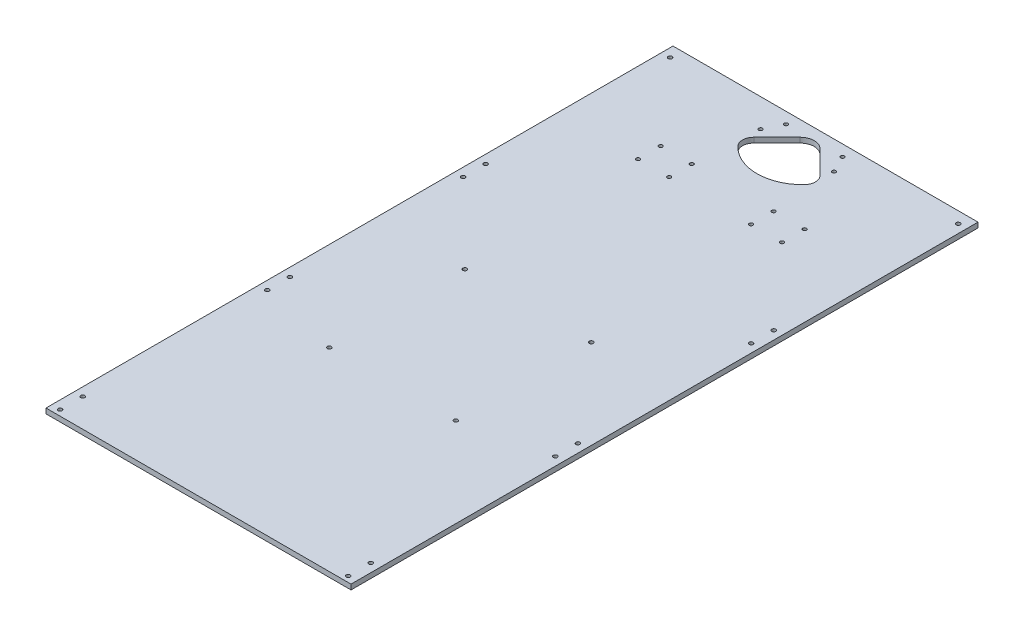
ISO-10303-21;
HEADER;
FILE_DESCRIPTION(('STEP AP214'),'2;1');
FILE_NAME('part.step','',(''),(''),'','','');
FILE_SCHEMA(('AUTOMOTIVE_DESIGN { 1 0 10303 214 1 1 1 1 }'));
ENDSEC;
DATA;
#1=APPLICATION_CONTEXT('core data for automotive mechanical design processes');
#2=APPLICATION_PROTOCOL_DEFINITION('international standard','automotive_design',2000,#1);
#3=PRODUCT_CONTEXT('',#1,'mechanical');
#4=PRODUCT('Part','Part','',(#3));
#5=PRODUCT_RELATED_PRODUCT_CATEGORY('part','',(#4));
#6=PRODUCT_DEFINITION_FORMATION('','',#4);
#7=PRODUCT_DEFINITION_CONTEXT('part definition',#1,'design');
#8=PRODUCT_DEFINITION('design','',#6,#7);
#9=PRODUCT_DEFINITION_SHAPE('','',#8);
#10=(LENGTH_UNIT() NAMED_UNIT(*) SI_UNIT(.MILLI.,.METRE.));
#11=(NAMED_UNIT(*) PLANE_ANGLE_UNIT() SI_UNIT($,.RADIAN.));
#12=(NAMED_UNIT(*) SI_UNIT($,.STERADIAN.) SOLID_ANGLE_UNIT());
#13=UNCERTAINTY_MEASURE_WITH_UNIT(LENGTH_MEASURE(1.E-05),#10,'distance_accuracy_value','');
#14=(GEOMETRIC_REPRESENTATION_CONTEXT(3) GLOBAL_UNCERTAINTY_ASSIGNED_CONTEXT((#13)) GLOBAL_UNIT_ASSIGNED_CONTEXT((#10,
#11,#12)) REPRESENTATION_CONTEXT('',''));
#15=CARTESIAN_POINT('',(0.,0.,0.));
#16=DIRECTION('',(0.,0.,1.));
#17=DIRECTION('',(1.,0.,0.));
#18=AXIS2_PLACEMENT_3D('',#15,#16,#17);
#19=CARTESIAN_POINT('',(0.,9.,-79.9999999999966));
#20=DIRECTION('',(0.,-1.,0.));
#21=DIRECTION('',(0.,0.,-1.));
#22=AXIS2_PLACEMENT_3D('',#19,#20,#21);
#23=CYLINDRICAL_SURFACE('',#22,81.4159283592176);
#24=CARTESIAN_POINT('',(0.,9.,-79.9999999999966));
#25=DIRECTION('',(0.,1.,0.));
#26=DIRECTION('',(0.,0.,1.));
#27=AXIS2_PLACEMENT_3D('',#24,#25,#26);
#28=CIRCLE('',#27,81.4159283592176);
#29=CARTESIAN_POINT('',(-58.9261399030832,9.,-23.8193678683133));
#30=VERTEX_POINT('',#29);
#31=CARTESIAN_POINT('',(58.9261399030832,9.,-23.8193678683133));
#32=VERTEX_POINT('',#31);
#33=EDGE_CURVE('E258',#30,#32,#28,.T.);
#34=ORIENTED_EDGE('',*,*,#33,.T.);
#35=DIRECTION('',(0.,-1.,0.));
#36=VECTOR('',#35,1.);
#37=CARTESIAN_POINT('',(58.9261399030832,9.,-23.8193678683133));
#38=LINE('',#37,#36);
#39=CARTESIAN_POINT('',(58.9261399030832,0.,-23.8193678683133));
#40=VERTEX_POINT('',#39);
#41=EDGE_CURVE('E350',#32,#40,#38,.T.);
#42=ORIENTED_EDGE('',*,*,#41,.T.);
#43=CARTESIAN_POINT('',(0.,0.,-79.9999999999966));
#44=DIRECTION('',(0.,1.,0.));
#45=DIRECTION('',(0.,0.,1.));
#46=AXIS2_PLACEMENT_3D('',#43,#44,#45);
#47=CIRCLE('',#46,81.4159283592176);
#48=CARTESIAN_POINT('',(-58.9261399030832,0.,-23.8193678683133));
#49=VERTEX_POINT('',#48);
#50=EDGE_CURVE('E314',#49,#40,#47,.T.);
#51=ORIENTED_EDGE('',*,*,#50,.F.);
#52=DIRECTION('',(0.,-1.,0.));
#53=VECTOR('',#52,1.);
#54=CARTESIAN_POINT('',(-58.9261399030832,9.,-23.8193678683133));
#55=LINE('',#54,#53);
#56=EDGE_CURVE('E344',#49,#30,#55,.F.);
#57=ORIENTED_EDGE('',*,*,#56,.T.);
#58=EDGE_LOOP('',(#34,#42,#51,#57));
#59=FACE_BOUND('',#58,.T.);
#60=ADVANCED_FACE('F45',(#59),#23,.F.);
#61=CARTESIAN_POINT('',(-55.177669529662,9.,-55.1776695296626));
#62=DIRECTION('',(0.707106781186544,0.,0.707106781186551));
#63=DIRECTION('',(0.707106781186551,0.,-0.707106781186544));
#64=AXIS2_PLACEMENT_3D('',#61,#62,#63);
#65=PLANE('',#64);
#66=DIRECTION('',(-0.707106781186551,0.,0.707106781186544));
#67=VECTOR('',#66,1.);
#68=CARTESIAN_POINT('',(-55.177669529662,9.,-55.1776695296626));
#69=LINE('',#68,#67);
#70=CARTESIAN_POINT('',(-17.6776695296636,9.,-92.6776695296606));
#71=VERTEX_POINT('',#70);
#72=CARTESIAN_POINT('',(-58.5929410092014,9.,-51.7623980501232));
#73=VERTEX_POINT('',#72);
#74=EDGE_CURVE('E261',#71,#73,#69,.T.);
#75=ORIENTED_EDGE('',*,*,#74,.T.);
#76=DIRECTION('',(0.,1.,0.));
#77=VECTOR('',#76,1.);
#78=CARTESIAN_POINT('',(-58.5929410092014,0.,-51.7623980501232));
#79=LINE('',#78,#77);
#80=CARTESIAN_POINT('',(-58.5929410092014,0.,-51.7623980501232));
#81=VERTEX_POINT('',#80);
#82=EDGE_CURVE('E341',#73,#81,#79,.F.);
#83=ORIENTED_EDGE('',*,*,#82,.T.);
#84=DIRECTION('',(-0.707106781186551,0.,0.707106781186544));
#85=VECTOR('',#84,1.);
#86=CARTESIAN_POINT('',(-55.177669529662,0.,-55.1776695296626));
#87=LINE('',#86,#85);
#88=CARTESIAN_POINT('',(-17.6776695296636,0.,-92.6776695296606));
#89=VERTEX_POINT('',#88);
#90=EDGE_CURVE('E316',#89,#81,#87,.T.);
#91=ORIENTED_EDGE('',*,*,#90,.F.);
#92=DIRECTION('',(0.,-1.,0.));
#93=VECTOR('',#92,1.);
#94=CARTESIAN_POINT('',(-17.6776695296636,9.,-92.6776695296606));
#95=LINE('',#94,#93);
#96=EDGE_CURVE('E339',#71,#89,#95,.T.);
#97=ORIENTED_EDGE('',*,*,#96,.F.);
#98=EDGE_LOOP('',(#75,#83,#91,#97));
#99=FACE_BOUND('',#98,.T.);
#100=ADVANCED_FACE('F368',(#99),#65,.T.);
#101=CARTESIAN_POINT('',(0.,9.,-74.9999999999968));
#102=DIRECTION('',(0.,-1.,0.));
#103=DIRECTION('',(0.,0.,-1.));
#104=AXIS2_PLACEMENT_3D('',#101,#102,#103);
#105=CYLINDRICAL_SURFACE('',#104,25.);
#106=CARTESIAN_POINT('',(0.,0.,-74.9999999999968));
#107=DIRECTION('',(0.,1.,0.));
#108=DIRECTION('',(0.,0.,1.));
#109=AXIS2_PLACEMENT_3D('',#106,#107,#108);
#110=CIRCLE('',#109,25.);
#111=CARTESIAN_POINT('',(17.6776695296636,0.,-92.6776695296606));
#112=VERTEX_POINT('',#111);
#113=EDGE_CURVE('E319',#112,#89,#110,.T.);
#114=ORIENTED_EDGE('',*,*,#113,.F.);
#115=DIRECTION('',(0.,-1.,0.));
#116=VECTOR('',#115,1.);
#117=CARTESIAN_POINT('',(17.6776695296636,9.,-92.6776695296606));
#118=LINE('',#117,#116);
#119=CARTESIAN_POINT('',(17.6776695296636,9.,-92.6776695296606));
#120=VERTEX_POINT('',#119);
#121=EDGE_CURVE('E167',#120,#112,#118,.T.);
#122=ORIENTED_EDGE('',*,*,#121,.F.);
#123=CARTESIAN_POINT('',(0.,9.,-74.9999999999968));
#124=DIRECTION('',(0.,1.,0.));
#125=DIRECTION('',(0.,0.,1.));
#126=AXIS2_PLACEMENT_3D('',#123,#124,#125);
#127=CIRCLE('',#126,25.);
#128=EDGE_CURVE('E264',#120,#71,#127,.T.);
#129=ORIENTED_EDGE('',*,*,#128,.T.);
#130=ORIENTED_EDGE('',*,*,#96,.T.);
#131=EDGE_LOOP('',(#114,#122,#129,#130));
#132=FACE_BOUND('',#131,.T.);
#133=ADVANCED_FACE('F374',(#132),#105,.F.);
#134=CARTESIAN_POINT('',(0.,9.,-119.999999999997));
#135=DIRECTION('',(0.,0.,-1.));
#136=DIRECTION('',(-1.,0.,0.));
#137=AXIS2_PLACEMENT_3D('',#134,#135,#136);
#138=PLANE('',#137);
#139=DIRECTION('',(1.,0.,0.));
#140=VECTOR('',#139,1.);
#141=CARTESIAN_POINT('',(0.,0.,-119.999999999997));
#142=LINE('',#141,#140);
#143=CARTESIAN_POINT('',(-270.,0.,-119.999999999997));
#144=VERTEX_POINT('',#143);
#145=CARTESIAN_POINT('',(270.,0.,-119.999999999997));
#146=VERTEX_POINT('',#145);
#147=EDGE_CURVE('E322',#144,#146,#142,.T.);
#148=ORIENTED_EDGE('',*,*,#147,.F.);
#149=DIRECTION('',(0.,-1.,0.));
#150=VECTOR('',#149,1.);
#151=CARTESIAN_POINT('',(-270.,9.,-119.999999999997));
#152=LINE('',#151,#150);
#153=CARTESIAN_POINT('',(-270.,9.,-119.999999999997));
#154=VERTEX_POINT('',#153);
#155=EDGE_CURVE('E337',#154,#144,#152,.T.);
#156=ORIENTED_EDGE('',*,*,#155,.F.);
#157=DIRECTION('',(1.,0.,0.));
#158=VECTOR('',#157,1.);
#159=CARTESIAN_POINT('',(0.,9.,-119.999999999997));
#160=LINE('',#159,#158);
#161=CARTESIAN_POINT('',(270.,9.,-119.999999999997));
#162=VERTEX_POINT('',#161);
#163=EDGE_CURVE('E267',#154,#162,#160,.T.);
#164=ORIENTED_EDGE('',*,*,#163,.T.);
#165=DIRECTION('',(0.,-1.,0.));
#166=VECTOR('',#165,1.);
#167=CARTESIAN_POINT('',(270.,9.,-119.999999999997));
#168=LINE('',#167,#166);
#169=EDGE_CURVE('E144',#162,#146,#168,.T.);
#170=ORIENTED_EDGE('',*,*,#169,.T.);
#171=EDGE_LOOP('',(#148,#156,#164,#170));
#172=FACE_BOUND('',#171,.T.);
#173=ADVANCED_FACE('F473',(#172),#138,.T.);
#174=CARTESIAN_POINT('',(-270.,9.,0.));
#175=DIRECTION('',(1.,0.,0.));
#176=DIRECTION('',(0.,0.,-1.));
#177=AXIS2_PLACEMENT_3D('',#174,#175,#176);
#178=PLANE('',#177);
#179=DIRECTION('',(0.,0.,1.));
#180=VECTOR('',#179,1.);
#181=CARTESIAN_POINT('',(-270.,0.,0.));
#182=LINE('',#181,#180);
#183=CARTESIAN_POINT('',(-270.,0.,990.000000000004));
#184=VERTEX_POINT('',#183);
#185=EDGE_CURVE('E324',#144,#184,#182,.T.);
#186=ORIENTED_EDGE('',*,*,#185,.T.);
#187=DIRECTION('',(0.,-1.,0.));
#188=VECTOR('',#187,1.);
#189=CARTESIAN_POINT('',(-270.,9.,990.000000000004));
#190=LINE('',#189,#188);
#191=CARTESIAN_POINT('',(-270.,9.,990.000000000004));
#192=VERTEX_POINT('',#191);
#193=EDGE_CURVE('E278',#192,#184,#190,.T.);
#194=ORIENTED_EDGE('',*,*,#193,.F.);
#195=DIRECTION('',(0.,0.,1.));
#196=VECTOR('',#195,1.);
#197=CARTESIAN_POINT('',(-270.,9.,0.));
#198=LINE('',#197,#196);
#199=EDGE_CURVE('E130',#154,#192,#198,.T.);
#200=ORIENTED_EDGE('',*,*,#199,.F.);
#201=ORIENTED_EDGE('',*,*,#155,.T.);
#202=EDGE_LOOP('',(#186,#194,#200,#201));
#203=FACE_BOUND('',#202,.T.);
#204=ADVANCED_FACE('F470',(#203),#178,.F.);
#205=CARTESIAN_POINT('',(0.,9.,990.000000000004));
#206=DIRECTION('',(0.,0.,-1.));
#207=DIRECTION('',(-1.,0.,0.));
#208=AXIS2_PLACEMENT_3D('',#205,#206,#207);
#209=PLANE('',#208);
#210=DIRECTION('',(1.,0.,0.));
#211=VECTOR('',#210,1.);
#212=CARTESIAN_POINT('',(0.,0.,990.000000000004));
#213=LINE('',#212,#211);
#214=CARTESIAN_POINT('',(270.,0.,990.000000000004));
#215=VERTEX_POINT('',#214);
#216=EDGE_CURVE('E139',#184,#215,#213,.T.);
#217=ORIENTED_EDGE('',*,*,#216,.T.);
#218=DIRECTION('',(0.,-1.,0.));
#219=VECTOR('',#218,1.);
#220=CARTESIAN_POINT('',(270.,9.,990.000000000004));
#221=LINE('',#220,#219);
#222=CARTESIAN_POINT('',(270.,9.,990.000000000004));
#223=VERTEX_POINT('',#222);
#224=EDGE_CURVE('E137',#223,#215,#221,.T.);
#225=ORIENTED_EDGE('',*,*,#224,.F.);
#226=DIRECTION('',(1.,0.,0.));
#227=VECTOR('',#226,1.);
#228=CARTESIAN_POINT('',(0.,9.,990.000000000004));
#229=LINE('',#228,#227);
#230=EDGE_CURVE('E122',#192,#223,#229,.T.);
#231=ORIENTED_EDGE('',*,*,#230,.F.);
#232=ORIENTED_EDGE('',*,*,#193,.T.);
#233=EDGE_LOOP('',(#217,#225,#231,#232));
#234=FACE_BOUND('',#233,.T.);
#235=ADVANCED_FACE('F138',(#234),#209,.F.);
#236=CARTESIAN_POINT('',(-112.,9.,406.483912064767));
#237=DIRECTION('',(0.,-1.,0.));
#238=DIRECTION('',(0.,0.,-1.));
#239=AXIS2_PLACEMENT_3D('',#236,#237,#238);
#240=CYLINDRICAL_SURFACE('',#239,3.49999999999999);
#241=CARTESIAN_POINT('',(-112.,9.,406.483912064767));
#242=DIRECTION('',(0.,1.,0.));
#243=DIRECTION('',(0.,0.,1.));
#244=AXIS2_PLACEMENT_3D('',#241,#242,#243);
#245=CIRCLE('',#244,3.49999999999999);
#246=CARTESIAN_POINT('',(-112.,9.,409.983912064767));
#247=VERTEX_POINT('',#246);
#248=EDGE_CURVE('E272',#247,#247,#245,.T.);
#249=ORIENTED_EDGE('',*,*,#248,.T.);
#250=EDGE_LOOP('',(#249));
#251=FACE_BOUND('',#250,.T.);
#252=CARTESIAN_POINT('',(-112.,0.,406.483912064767));
#253=DIRECTION('',(0.,1.,0.));
#254=DIRECTION('',(0.,0.,1.));
#255=AXIS2_PLACEMENT_3D('',#252,#253,#254);
#256=CIRCLE('',#255,3.49999999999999);
#257=CARTESIAN_POINT('',(-112.,0.,409.983912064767));
#258=VERTEX_POINT('',#257);
#259=EDGE_CURVE('E331',#258,#258,#256,.T.);
#260=ORIENTED_EDGE('',*,*,#259,.F.);
#261=EDGE_LOOP('',(#260));
#262=FACE_BOUND('',#261,.T.);
#263=ADVANCED_FACE('F461',(#251,#262),#240,.F.);
#264=CARTESIAN_POINT('',(-112.,9.,646.483912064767));
#265=DIRECTION('',(0.,-1.,0.));
#266=DIRECTION('',(0.,0.,-1.));
#267=AXIS2_PLACEMENT_3D('',#264,#265,#266);
#268=CYLINDRICAL_SURFACE('',#267,3.49999999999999);
#269=CARTESIAN_POINT('',(-112.,9.,646.483912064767));
#270=DIRECTION('',(0.,1.,0.));
#271=DIRECTION('',(0.,0.,1.));
#272=AXIS2_PLACEMENT_3D('',#269,#270,#271);
#273=CIRCLE('',#272,3.49999999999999);
#274=CARTESIAN_POINT('',(-112.,9.,649.983912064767));
#275=VERTEX_POINT('',#274);
#276=EDGE_CURVE('E134',#275,#275,#273,.T.);
#277=ORIENTED_EDGE('',*,*,#276,.T.);
#278=EDGE_LOOP('',(#277));
#279=FACE_BOUND('',#278,.T.);
#280=CARTESIAN_POINT('',(-112.,0.,646.483912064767));
#281=DIRECTION('',(0.,1.,0.));
#282=DIRECTION('',(0.,0.,1.));
#283=AXIS2_PLACEMENT_3D('',#280,#281,#282);
#284=CIRCLE('',#283,3.49999999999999);
#285=CARTESIAN_POINT('',(-112.,0.,649.983912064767));
#286=VERTEX_POINT('',#285);
#287=EDGE_CURVE('E328',#286,#286,#284,.T.);
#288=ORIENTED_EDGE('',*,*,#287,.F.);
#289=EDGE_LOOP('',(#288));
#290=FACE_BOUND('',#289,.T.);
#291=ADVANCED_FACE('F398',(#279,#290),#268,.F.);
#292=CARTESIAN_POINT('',(-65.,9.,-69.9999999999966));
#293=DIRECTION('',(0.,-1.,0.));
#294=DIRECTION('',(0.,0.,-1.));
#295=AXIS2_PLACEMENT_3D('',#292,#293,#294);
#296=CYLINDRICAL_SURFACE('',#295,3.25000000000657);
#297=CARTESIAN_POINT('',(-65.,9.,-69.9999999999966));
#298=DIRECTION('',(0.,1.,0.));
#299=DIRECTION('',(0.,0.,1.));
#300=AXIS2_PLACEMENT_3D('',#297,#298,#299);
#301=CIRCLE('',#300,3.25000000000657);
#302=CARTESIAN_POINT('',(-65.,9.,-66.74999999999));
#303=VERTEX_POINT('',#302);
#304=EDGE_CURVE('E255',#303,#303,#301,.T.);
#305=ORIENTED_EDGE('',*,*,#304,.T.);
#306=EDGE_LOOP('',(#305));
#307=FACE_BOUND('',#306,.T.);
#308=CARTESIAN_POINT('',(-65.,0.,-69.9999999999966));
#309=DIRECTION('',(0.,1.,0.));
#310=DIRECTION('',(0.,0.,1.));
#311=AXIS2_PLACEMENT_3D('',#308,#309,#310);
#312=CIRCLE('',#311,3.25000000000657);
#313=CARTESIAN_POINT('',(-65.,0.,-66.74999999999));
#314=VERTEX_POINT('',#313);
#315=EDGE_CURVE('E311',#314,#314,#312,.T.);
#316=ORIENTED_EDGE('',*,*,#315,.F.);
#317=EDGE_LOOP('',(#316));
#318=FACE_BOUND('',#317,.T.);
#319=ADVANCED_FACE('F394',(#307,#318),#296,.F.);
#320=CARTESIAN_POINT('',(-127.5,9.,44.3400000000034));
#321=DIRECTION('',(0.,-1.,0.));
#322=DIRECTION('',(0.,0.,-1.));
#323=AXIS2_PLACEMENT_3D('',#320,#321,#322);
#324=CYLINDRICAL_SURFACE('',#323,3.25000000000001);
#325=CARTESIAN_POINT('',(-127.5,9.,44.3400000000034));
#326=DIRECTION('',(0.,1.,0.));
#327=DIRECTION('',(0.,0.,1.));
#328=AXIS2_PLACEMENT_3D('',#325,#326,#327);
#329=CIRCLE('',#328,3.25000000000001);
#330=CARTESIAN_POINT('',(-127.5,9.,47.5900000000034));
#331=VERTEX_POINT('',#330);
#332=EDGE_CURVE('E252',#331,#331,#329,.T.);
#333=ORIENTED_EDGE('',*,*,#332,.T.);
#334=EDGE_LOOP('',(#333));
#335=FACE_BOUND('',#334,.T.);
#336=CARTESIAN_POINT('',(-127.5,0.,44.3400000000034));
#337=DIRECTION('',(0.,1.,0.));
#338=DIRECTION('',(0.,0.,1.));
#339=AXIS2_PLACEMENT_3D('',#336,#337,#338);
#340=CIRCLE('',#339,3.25000000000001);
#341=CARTESIAN_POINT('',(-127.5,0.,47.5900000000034));
#342=VERTEX_POINT('',#341);
#343=EDGE_CURVE('E308',#342,#342,#340,.T.);
#344=ORIENTED_EDGE('',*,*,#343,.F.);
#345=EDGE_LOOP('',(#344));
#346=FACE_BOUND('',#345,.T.);
#347=ADVANCED_FACE('F397',(#335,#346),#324,.F.);
#348=CARTESIAN_POINT('',(-72.5,9.,44.3400000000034));
#349=DIRECTION('',(0.,-1.,0.));
#350=DIRECTION('',(0.,0.,-1.));
#351=AXIS2_PLACEMENT_3D('',#348,#349,#350);
#352=CYLINDRICAL_SURFACE('',#351,3.25000000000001);
#353=CARTESIAN_POINT('',(-72.5,9.,44.3400000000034));
#354=DIRECTION('',(0.,1.,0.));
#355=DIRECTION('',(0.,0.,1.));
#356=AXIS2_PLACEMENT_3D('',#353,#354,#355);
#357=CIRCLE('',#356,3.25000000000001);
#358=CARTESIAN_POINT('',(-72.5,9.,47.5900000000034));
#359=VERTEX_POINT('',#358);
#360=EDGE_CURVE('E249',#359,#359,#357,.T.);
#361=ORIENTED_EDGE('',*,*,#360,.T.);
#362=EDGE_LOOP('',(#361));
#363=FACE_BOUND('',#362,.T.);
#364=CARTESIAN_POINT('',(-72.5,0.,44.3400000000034));
#365=DIRECTION('',(0.,1.,0.));
#366=DIRECTION('',(0.,0.,1.));
#367=AXIS2_PLACEMENT_3D('',#364,#365,#366);
#368=CIRCLE('',#367,3.25000000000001);
#369=CARTESIAN_POINT('',(-72.5,0.,47.5900000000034));
#370=VERTEX_POINT('',#369);
#371=EDGE_CURVE('E305',#370,#370,#368,.T.);
#372=ORIENTED_EDGE('',*,*,#371,.F.);
#373=EDGE_LOOP('',(#372));
#374=FACE_BOUND('',#373,.T.);
#375=ADVANCED_FACE('F402',(#363,#374),#352,.F.);
#376=CARTESIAN_POINT('',(-72.5,9.,84.3400000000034));
#377=DIRECTION('',(0.,-1.,0.));
#378=DIRECTION('',(0.,0.,-1.));
#379=AXIS2_PLACEMENT_3D('',#376,#377,#378);
#380=CYLINDRICAL_SURFACE('',#379,3.25000000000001);
#381=CARTESIAN_POINT('',(-72.5,9.,84.3400000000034));
#382=DIRECTION('',(0.,1.,0.));
#383=DIRECTION('',(0.,0.,1.));
#384=AXIS2_PLACEMENT_3D('',#381,#382,#383);
#385=CIRCLE('',#384,3.25000000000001);
#386=CARTESIAN_POINT('',(-72.5,9.,87.5900000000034));
#387=VERTEX_POINT('',#386);
#388=EDGE_CURVE('E246',#387,#387,#385,.T.);
#389=ORIENTED_EDGE('',*,*,#388,.T.);
#390=EDGE_LOOP('',(#389));
#391=FACE_BOUND('',#390,.T.);
#392=CARTESIAN_POINT('',(-72.5,0.,84.3400000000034));
#393=DIRECTION('',(0.,1.,0.));
#394=DIRECTION('',(0.,0.,1.));
#395=AXIS2_PLACEMENT_3D('',#392,#393,#394);
#396=CIRCLE('',#395,3.25000000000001);
#397=CARTESIAN_POINT('',(-72.5,0.,87.5900000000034));
#398=VERTEX_POINT('',#397);
#399=EDGE_CURVE('E302',#398,#398,#396,.T.);
#400=ORIENTED_EDGE('',*,*,#399,.F.);
#401=EDGE_LOOP('',(#400));
#402=FACE_BOUND('',#401,.T.);
#403=ADVANCED_FACE('F406',(#391,#402),#380,.F.);
#404=CARTESIAN_POINT('',(-127.5,9.,84.3400000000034));
#405=DIRECTION('',(0.,-1.,0.));
#406=DIRECTION('',(0.,0.,-1.));
#407=AXIS2_PLACEMENT_3D('',#404,#405,#406);
#408=CYLINDRICAL_SURFACE('',#407,3.25000000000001);
#409=CARTESIAN_POINT('',(-127.5,9.,84.3400000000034));
#410=DIRECTION('',(0.,1.,0.));
#411=DIRECTION('',(0.,0.,1.));
#412=AXIS2_PLACEMENT_3D('',#409,#410,#411);
#413=CIRCLE('',#412,3.25000000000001);
#414=CARTESIAN_POINT('',(-127.5,9.,87.5900000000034));
#415=VERTEX_POINT('',#414);
#416=EDGE_CURVE('E243',#415,#415,#413,.T.);
#417=ORIENTED_EDGE('',*,*,#416,.T.);
#418=EDGE_LOOP('',(#417));
#419=FACE_BOUND('',#418,.T.);
#420=CARTESIAN_POINT('',(-127.5,0.,84.3400000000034));
#421=DIRECTION('',(0.,1.,0.));
#422=DIRECTION('',(0.,0.,1.));
#423=AXIS2_PLACEMENT_3D('',#420,#421,#422);
#424=CIRCLE('',#423,3.25000000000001);
#425=CARTESIAN_POINT('',(-127.5,0.,87.5900000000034));
#426=VERTEX_POINT('',#425);
#427=EDGE_CURVE('E299',#426,#426,#424,.T.);
#428=ORIENTED_EDGE('',*,*,#427,.F.);
#429=EDGE_LOOP('',(#428));
#430=FACE_BOUND('',#429,.T.);
#431=ADVANCED_FACE('F410',(#419,#430),#408,.F.);
#432=CARTESIAN_POINT('',(-255.,9.,226.66666666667));
#433=DIRECTION('',(0.,-1.,0.));
#434=DIRECTION('',(0.,0.,-1.));
#435=AXIS2_PLACEMENT_3D('',#432,#433,#434);
#436=CYLINDRICAL_SURFACE('',#435,3.50000000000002);
#437=CARTESIAN_POINT('',(-255.,9.,226.66666666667));
#438=DIRECTION('',(0.,1.,0.));
#439=DIRECTION('',(0.,0.,1.));
#440=AXIS2_PLACEMENT_3D('',#437,#438,#439);
#441=CIRCLE('',#440,3.50000000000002);
#442=CARTESIAN_POINT('',(-255.,9.,230.16666666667));
#443=VERTEX_POINT('',#442);
#444=EDGE_CURVE('E240',#443,#443,#441,.T.);
#445=ORIENTED_EDGE('',*,*,#444,.T.);
#446=EDGE_LOOP('',(#445));
#447=FACE_BOUND('',#446,.T.);
#448=CARTESIAN_POINT('',(-255.,0.,226.66666666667));
#449=DIRECTION('',(0.,1.,0.));
#450=DIRECTION('',(0.,0.,1.));
#451=AXIS2_PLACEMENT_3D('',#448,#449,#450);
#452=CIRCLE('',#451,3.50000000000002);
#453=CARTESIAN_POINT('',(-255.,0.,230.16666666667));
#454=VERTEX_POINT('',#453);
#455=EDGE_CURVE('E296',#454,#454,#452,.T.);
#456=ORIENTED_EDGE('',*,*,#455,.F.);
#457=EDGE_LOOP('',(#456));
#458=FACE_BOUND('',#457,.T.);
#459=ADVANCED_FACE('F414',(#447,#458),#436,.F.);
#460=CARTESIAN_POINT('',(-255.,9.,613.333333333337));
#461=DIRECTION('',(0.,-1.,0.));
#462=DIRECTION('',(0.,0.,-1.));
#463=AXIS2_PLACEMENT_3D('',#460,#461,#462);
#464=CYLINDRICAL_SURFACE('',#463,3.50000000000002);
#465=CARTESIAN_POINT('',(-255.,9.,613.333333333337));
#466=DIRECTION('',(0.,1.,0.));
#467=DIRECTION('',(0.,0.,1.));
#468=AXIS2_PLACEMENT_3D('',#465,#466,#467);
#469=CIRCLE('',#468,3.50000000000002);
#470=CARTESIAN_POINT('',(-255.,9.,616.833333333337));
#471=VERTEX_POINT('',#470);
#472=EDGE_CURVE('E237',#471,#471,#469,.T.);
#473=ORIENTED_EDGE('',*,*,#472,.T.);
#474=EDGE_LOOP('',(#473));
#475=FACE_BOUND('',#474,.T.);
#476=CARTESIAN_POINT('',(-255.,0.,613.333333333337));
#477=DIRECTION('',(0.,1.,0.));
#478=DIRECTION('',(0.,0.,1.));
#479=AXIS2_PLACEMENT_3D('',#476,#477,#478);
#480=CIRCLE('',#479,3.50000000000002);
#481=CARTESIAN_POINT('',(-255.,0.,616.833333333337));
#482=VERTEX_POINT('',#481);
#483=EDGE_CURVE('E293',#482,#482,#480,.T.);
#484=ORIENTED_EDGE('',*,*,#483,.F.);
#485=EDGE_LOOP('',(#484));
#486=FACE_BOUND('',#485,.T.);
#487=ADVANCED_FACE('F418',(#475,#486),#464,.F.);
#488=CARTESIAN_POINT('',(-255.,9.,573.333333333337));
#489=DIRECTION('',(0.,-1.,0.));
#490=DIRECTION('',(0.,0.,-1.));
#491=AXIS2_PLACEMENT_3D('',#488,#489,#490);
#492=CYLINDRICAL_SURFACE('',#491,3.50000000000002);
#493=CARTESIAN_POINT('',(-255.,9.,573.333333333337));
#494=DIRECTION('',(0.,1.,0.));
#495=DIRECTION('',(0.,0.,1.));
#496=AXIS2_PLACEMENT_3D('',#493,#494,#495);
#497=CIRCLE('',#496,3.50000000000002);
#498=CARTESIAN_POINT('',(-255.,9.,576.833333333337));
#499=VERTEX_POINT('',#498);
#500=EDGE_CURVE('E234',#499,#499,#497,.T.);
#501=ORIENTED_EDGE('',*,*,#500,.T.);
#502=EDGE_LOOP('',(#501));
#503=FACE_BOUND('',#502,.T.);
#504=CARTESIAN_POINT('',(-255.,0.,573.333333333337));
#505=DIRECTION('',(0.,1.,0.));
#506=DIRECTION('',(0.,0.,1.));
#507=AXIS2_PLACEMENT_3D('',#504,#505,#506);
#508=CIRCLE('',#507,3.50000000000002);
#509=CARTESIAN_POINT('',(-255.,0.,576.833333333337));
#510=VERTEX_POINT('',#509);
#511=EDGE_CURVE('E290',#510,#510,#508,.T.);
#512=ORIENTED_EDGE('',*,*,#511,.F.);
#513=EDGE_LOOP('',(#512));
#514=FACE_BOUND('',#513,.T.);
#515=ADVANCED_FACE('F422',(#503,#514),#492,.F.);
#516=CARTESIAN_POINT('',(-255.,9.,266.66666666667));
#517=DIRECTION('',(0.,-1.,0.));
#518=DIRECTION('',(0.,0.,-1.));
#519=AXIS2_PLACEMENT_3D('',#516,#517,#518);
#520=CYLINDRICAL_SURFACE('',#519,3.50000000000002);
#521=CARTESIAN_POINT('',(-255.,9.,266.66666666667));
#522=DIRECTION('',(0.,1.,0.));
#523=DIRECTION('',(0.,0.,1.));
#524=AXIS2_PLACEMENT_3D('',#521,#522,#523);
#525=CIRCLE('',#524,3.50000000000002);
#526=CARTESIAN_POINT('',(-255.,9.,270.16666666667));
#527=VERTEX_POINT('',#526);
#528=EDGE_CURVE('E231',#527,#527,#525,.T.);
#529=ORIENTED_EDGE('',*,*,#528,.T.);
#530=EDGE_LOOP('',(#529));
#531=FACE_BOUND('',#530,.T.);
#532=CARTESIAN_POINT('',(-255.,0.,266.66666666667));
#533=DIRECTION('',(0.,1.,0.));
#534=DIRECTION('',(0.,0.,1.));
#535=AXIS2_PLACEMENT_3D('',#532,#533,#534);
#536=CIRCLE('',#535,3.50000000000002);
#537=CARTESIAN_POINT('',(-255.,0.,270.16666666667));
#538=VERTEX_POINT('',#537);
#539=EDGE_CURVE('E287',#538,#538,#536,.T.);
#540=ORIENTED_EDGE('',*,*,#539,.F.);
#541=EDGE_LOOP('',(#540));
#542=FACE_BOUND('',#541,.T.);
#543=ADVANCED_FACE('F426',(#531,#542),#520,.F.);
#544=CARTESIAN_POINT('',(-255.,9.,-99.9999999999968));
#545=DIRECTION('',(0.,-1.,0.));
#546=DIRECTION('',(0.,0.,-1.));
#547=AXIS2_PLACEMENT_3D('',#544,#545,#546);
#548=CYLINDRICAL_SURFACE('',#547,3.50000000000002);
#549=CARTESIAN_POINT('',(-255.,9.,-99.9999999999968));
#550=DIRECTION('',(0.,1.,0.));
#551=DIRECTION('',(0.,0.,1.));
#552=AXIS2_PLACEMENT_3D('',#549,#550,#551);
#553=CIRCLE('',#552,3.50000000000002);
#554=CARTESIAN_POINT('',(-255.,9.,-96.4999999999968));
#555=VERTEX_POINT('',#554);
#556=EDGE_CURVE('E228',#555,#555,#553,.T.);
#557=ORIENTED_EDGE('',*,*,#556,.T.);
#558=EDGE_LOOP('',(#557));
#559=FACE_BOUND('',#558,.T.);
#560=CARTESIAN_POINT('',(-255.,0.,-99.9999999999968));
#561=DIRECTION('',(0.,1.,0.));
#562=DIRECTION('',(0.,0.,1.));
#563=AXIS2_PLACEMENT_3D('',#560,#561,#562);
#564=CIRCLE('',#563,3.50000000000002);
#565=CARTESIAN_POINT('',(-255.,0.,-96.4999999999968));
#566=VERTEX_POINT('',#565);
#567=EDGE_CURVE('E284',#566,#566,#564,.T.);
#568=ORIENTED_EDGE('',*,*,#567,.F.);
#569=EDGE_LOOP('',(#568));
#570=FACE_BOUND('',#569,.T.);
#571=ADVANCED_FACE('F430',(#559,#570),#548,.F.);
#572=CARTESIAN_POINT('',(-255.,9.,980.000000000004));
#573=DIRECTION('',(0.,-1.,0.));
#574=DIRECTION('',(0.,0.,-1.));
#575=AXIS2_PLACEMENT_3D('',#572,#573,#574);
#576=CYLINDRICAL_SURFACE('',#575,3.50000000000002);
#577=CARTESIAN_POINT('',(-255.,9.,980.000000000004));
#578=DIRECTION('',(0.,1.,0.));
#579=DIRECTION('',(0.,0.,1.));
#580=AXIS2_PLACEMENT_3D('',#577,#578,#579);
#581=CIRCLE('',#580,3.50000000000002);
#582=CARTESIAN_POINT('',(-255.,9.,983.500000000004));
#583=VERTEX_POINT('',#582);
#584=EDGE_CURVE('E224',#583,#583,#581,.T.);
#585=ORIENTED_EDGE('',*,*,#584,.T.);
#586=EDGE_LOOP('',(#585));
#587=FACE_BOUND('',#586,.T.);
#588=CARTESIAN_POINT('',(-255.,0.,980.000000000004));
#589=DIRECTION('',(0.,1.,0.));
#590=DIRECTION('',(0.,0.,1.));
#591=AXIS2_PLACEMENT_3D('',#588,#589,#590);
#592=CIRCLE('',#591,3.50000000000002);
#593=CARTESIAN_POINT('',(-255.,0.,983.500000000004));
#594=VERTEX_POINT('',#593);
#595=EDGE_CURVE('E281',#594,#594,#592,.T.);
#596=ORIENTED_EDGE('',*,*,#595,.F.);
#597=EDGE_LOOP('',(#596));
#598=FACE_BOUND('',#597,.T.);
#599=ADVANCED_FACE('F434',(#587,#598),#576,.F.);
#600=CARTESIAN_POINT('',(-255.,9.,940.000000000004));
#601=DIRECTION('',(0.,-1.,0.));
#602=DIRECTION('',(0.,0.,-1.));
#603=AXIS2_PLACEMENT_3D('',#600,#601,#602);
#604=CYLINDRICAL_SURFACE('',#603,3.50000000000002);
#605=CARTESIAN_POINT('',(-255.,9.,940.000000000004));
#606=DIRECTION('',(0.,1.,0.));
#607=DIRECTION('',(0.,0.,1.));
#608=AXIS2_PLACEMENT_3D('',#605,#606,#607);
#609=CIRCLE('',#608,3.50000000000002);
#610=CARTESIAN_POINT('',(-255.,9.,943.500000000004));
#611=VERTEX_POINT('',#610);
#612=EDGE_CURVE('E221',#611,#611,#609,.T.);
#613=ORIENTED_EDGE('',*,*,#612,.T.);
#614=EDGE_LOOP('',(#613));
#615=FACE_BOUND('',#614,.T.);
#616=CARTESIAN_POINT('',(-255.,0.,940.000000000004));
#617=DIRECTION('',(0.,1.,0.));
#618=DIRECTION('',(0.,0.,1.));
#619=AXIS2_PLACEMENT_3D('',#616,#617,#618);
#620=CIRCLE('',#619,3.50000000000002);
#621=CARTESIAN_POINT('',(-255.,0.,943.500000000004));
#622=VERTEX_POINT('',#621);
#623=EDGE_CURVE('E143',#622,#622,#620,.T.);
#624=ORIENTED_EDGE('',*,*,#623,.F.);
#625=EDGE_LOOP('',(#624));
#626=FACE_BOUND('',#625,.T.);
#627=ADVANCED_FACE('F438',(#615,#626),#604,.F.);
#628=CARTESIAN_POINT('',(-50.,9.,-99.9999999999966));
#629=DIRECTION('',(0.,-1.,0.));
#630=DIRECTION('',(0.,0.,-1.));
#631=AXIS2_PLACEMENT_3D('',#628,#629,#630);
#632=CYLINDRICAL_SURFACE('',#631,3.25000000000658);
#633=CARTESIAN_POINT('',(-50.,9.,-99.9999999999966));
#634=DIRECTION('',(0.,1.,0.));
#635=DIRECTION('',(0.,0.,1.));
#636=AXIS2_PLACEMENT_3D('',#633,#634,#635);
#637=CIRCLE('',#636,3.25000000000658);
#638=CARTESIAN_POINT('',(-50.,9.,-96.74999999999));
#639=VERTEX_POINT('',#638);
#640=EDGE_CURVE('E275',#639,#639,#637,.T.);
#641=ORIENTED_EDGE('',*,*,#640,.T.);
#642=EDGE_LOOP('',(#641));
#643=FACE_BOUND('',#642,.T.);
#644=CARTESIAN_POINT('',(-50.,0.,-99.9999999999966));
#645=DIRECTION('',(0.,1.,0.));
#646=DIRECTION('',(0.,0.,1.));
#647=AXIS2_PLACEMENT_3D('',#644,#645,#646);
#648=CIRCLE('',#647,3.25000000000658);
#649=CARTESIAN_POINT('',(-50.,0.,-96.74999999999));
#650=VERTEX_POINT('',#649);
#651=EDGE_CURVE('E225',#650,#650,#648,.T.);
#652=ORIENTED_EDGE('',*,*,#651,.F.);
#653=EDGE_LOOP('',(#652));
#654=FACE_BOUND('',#653,.T.);
#655=ADVANCED_FACE('F441',(#643,#654),#632,.F.);
#656=CARTESIAN_POINT('',(0.,9.,0.));
#657=DIRECTION('',(0.,1.,0.));
#658=DIRECTION('',(0.,0.,1.));
#659=AXIS2_PLACEMENT_3D('',#656,#657,#658);
#660=PLANE('',#659);
#661=ORIENTED_EDGE('',*,*,#230,.T.);
#662=DIRECTION('',(0.,0.,1.));
#663=VECTOR('',#662,1.);
#664=CARTESIAN_POINT('',(270.,9.,0.));
#665=LINE('',#664,#663);
#666=EDGE_CURVE('E128',#162,#223,#665,.T.);
#667=ORIENTED_EDGE('',*,*,#666,.F.);
#668=ORIENTED_EDGE('',*,*,#163,.F.);
#669=ORIENTED_EDGE('',*,*,#199,.T.);
#670=EDGE_LOOP('',(#661,#667,#668,#669));
#671=FACE_BOUND('',#670,.T.);
#672=ORIENTED_EDGE('',*,*,#612,.F.);
#673=EDGE_LOOP('',(#672));
#674=FACE_BOUND('',#673,.T.);
#675=ORIENTED_EDGE('',*,*,#584,.F.);
#676=EDGE_LOOP('',(#675));
#677=FACE_BOUND('',#676,.T.);
#678=ORIENTED_EDGE('',*,*,#556,.F.);
#679=EDGE_LOOP('',(#678));
#680=FACE_BOUND('',#679,.T.);
#681=ORIENTED_EDGE('',*,*,#528,.F.);
#682=EDGE_LOOP('',(#681));
#683=FACE_BOUND('',#682,.T.);
#684=ORIENTED_EDGE('',*,*,#500,.F.);
#685=EDGE_LOOP('',(#684));
#686=FACE_BOUND('',#685,.T.);
#687=ORIENTED_EDGE('',*,*,#472,.F.);
#688=EDGE_LOOP('',(#687));
#689=FACE_BOUND('',#688,.T.);
#690=ORIENTED_EDGE('',*,*,#444,.F.);
#691=EDGE_LOOP('',(#690));
#692=FACE_BOUND('',#691,.T.);
#693=ORIENTED_EDGE('',*,*,#416,.F.);
#694=EDGE_LOOP('',(#693));
#695=FACE_BOUND('',#694,.T.);
#696=ORIENTED_EDGE('',*,*,#388,.F.);
#697=EDGE_LOOP('',(#696));
#698=FACE_BOUND('',#697,.T.);
#699=ORIENTED_EDGE('',*,*,#360,.F.);
#700=EDGE_LOOP('',(#699));
#701=FACE_BOUND('',#700,.T.);
#702=ORIENTED_EDGE('',*,*,#332,.F.);
#703=EDGE_LOOP('',(#702));
#704=FACE_BOUND('',#703,.T.);
#705=ORIENTED_EDGE('',*,*,#304,.F.);
#706=EDGE_LOOP('',(#705));
#707=FACE_BOUND('',#706,.T.);
#708=ORIENTED_EDGE('',*,*,#33,.F.);
#709=CARTESIAN_POINT('',(-44.4508053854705,9.,-37.6202624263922));
#710=DIRECTION('',(0.,1.,0.));
#711=DIRECTION('',(0.,0.,1.));
#712=AXIS2_PLACEMENT_3D('',#709,#710,#711);
#713=CIRCLE('',#712,20.);
#714=EDGE_CURVE('E348',#30,#73,#713,.F.);
#715=ORIENTED_EDGE('',*,*,#714,.T.);
#716=ORIENTED_EDGE('',*,*,#74,.F.);
#717=ORIENTED_EDGE('',*,*,#128,.F.);
#718=DIRECTION('',(0.707106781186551,0.,0.707106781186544));
#719=VECTOR('',#718,1.);
#720=CARTESIAN_POINT('',(55.177669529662,9.,-55.1776695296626));
#721=LINE('',#720,#719);
#722=CARTESIAN_POINT('',(58.5929410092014,9.,-51.7623980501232));
#723=VERTEX_POINT('',#722);
#724=EDGE_CURVE('E149',#120,#723,#721,.T.);
#725=ORIENTED_EDGE('',*,*,#724,.T.);
#726=CARTESIAN_POINT('',(44.4508053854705,9.,-37.6202624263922));
#727=DIRECTION('',(0.,1.,0.));
#728=DIRECTION('',(0.,0.,1.));
#729=AXIS2_PLACEMENT_3D('',#726,#727,#728);
#730=CIRCLE('',#729,20.);
#731=EDGE_CURVE('E11',#723,#32,#730,.F.);
#732=ORIENTED_EDGE('',*,*,#731,.T.);
#733=EDGE_LOOP('',(#708,#715,#716,#717,#725,#732));
#734=FACE_BOUND('',#733,.T.);
#735=ORIENTED_EDGE('',*,*,#276,.F.);
#736=EDGE_LOOP('',(#735));
#737=FACE_BOUND('',#736,.T.);
#738=ORIENTED_EDGE('',*,*,#248,.F.);
#739=EDGE_LOOP('',(#738));
#740=FACE_BOUND('',#739,.T.);
#741=ORIENTED_EDGE('',*,*,#640,.F.);
#742=EDGE_LOOP('',(#741));
#743=FACE_BOUND('',#742,.T.);
#744=CARTESIAN_POINT('',(255.,9.,940.000000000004));
#745=DIRECTION('',(0.,-1.,0.));
#746=DIRECTION('',(0.,0.,1.));
#747=AXIS2_PLACEMENT_3D('',#744,#745,#746);
#748=CIRCLE('',#747,3.50000000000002);
#749=CARTESIAN_POINT('',(255.,9.,943.500000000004));
#750=VERTEX_POINT('',#749);
#751=EDGE_CURVE('E217',#750,#750,#748,.T.);
#752=ORIENTED_EDGE('',*,*,#751,.T.);
#753=EDGE_LOOP('',(#752));
#754=FACE_BOUND('',#753,.T.);
#755=CARTESIAN_POINT('',(255.,9.,980.000000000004));
#756=DIRECTION('',(0.,-1.,0.));
#757=DIRECTION('',(0.,0.,1.));
#758=AXIS2_PLACEMENT_3D('',#755,#756,#757);
#759=CIRCLE('',#758,3.50000000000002);
#760=CARTESIAN_POINT('',(255.,9.,983.500000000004));
#761=VERTEX_POINT('',#760);
#762=EDGE_CURVE('E717',#761,#761,#759,.T.);
#763=ORIENTED_EDGE('',*,*,#762,.T.);
#764=EDGE_LOOP('',(#763));
#765=FACE_BOUND('',#764,.T.);
#766=CARTESIAN_POINT('',(255.,9.,-99.9999999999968));
#767=DIRECTION('',(0.,-1.,0.));
#768=DIRECTION('',(0.,0.,1.));
#769=AXIS2_PLACEMENT_3D('',#766,#767,#768);
#770=CIRCLE('',#769,3.50000000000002);
#771=CARTESIAN_POINT('',(255.,9.,-96.4999999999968));
#772=VERTEX_POINT('',#771);
#773=EDGE_CURVE('E720',#772,#772,#770,.T.);
#774=ORIENTED_EDGE('',*,*,#773,.T.);
#775=EDGE_LOOP('',(#774));
#776=FACE_BOUND('',#775,.T.);
#777=CARTESIAN_POINT('',(255.,9.,266.66666666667));
#778=DIRECTION('',(0.,-1.,0.));
#779=DIRECTION('',(0.,0.,1.));
#780=AXIS2_PLACEMENT_3D('',#777,#778,#779);
#781=CIRCLE('',#780,3.50000000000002);
#782=CARTESIAN_POINT('',(255.,9.,270.16666666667));
#783=VERTEX_POINT('',#782);
#784=EDGE_CURVE('E725',#783,#783,#781,.T.);
#785=ORIENTED_EDGE('',*,*,#784,.T.);
#786=EDGE_LOOP('',(#785));
#787=FACE_BOUND('',#786,.T.);
#788=CARTESIAN_POINT('',(255.,9.,573.333333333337));
#789=DIRECTION('',(0.,-1.,0.));
#790=DIRECTION('',(0.,0.,1.));
#791=AXIS2_PLACEMENT_3D('',#788,#789,#790);
#792=CIRCLE('',#791,3.50000000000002);
#793=CARTESIAN_POINT('',(255.,9.,576.833333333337));
#794=VERTEX_POINT('',#793);
#795=EDGE_CURVE('E728',#794,#794,#792,.T.);
#796=ORIENTED_EDGE('',*,*,#795,.T.);
#797=EDGE_LOOP('',(#796));
#798=FACE_BOUND('',#797,.T.);
#799=CARTESIAN_POINT('',(255.,9.,613.333333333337));
#800=DIRECTION('',(0.,-1.,0.));
#801=DIRECTION('',(0.,0.,1.));
#802=AXIS2_PLACEMENT_3D('',#799,#800,#801);
#803=CIRCLE('',#802,3.50000000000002);
#804=CARTESIAN_POINT('',(255.,9.,616.833333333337));
#805=VERTEX_POINT('',#804);
#806=EDGE_CURVE('E731',#805,#805,#803,.T.);
#807=ORIENTED_EDGE('',*,*,#806,.T.);
#808=EDGE_LOOP('',(#807));
#809=FACE_BOUND('',#808,.T.);
#810=CARTESIAN_POINT('',(255.,9.,226.66666666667));
#811=DIRECTION('',(0.,-1.,0.));
#812=DIRECTION('',(0.,0.,1.));
#813=AXIS2_PLACEMENT_3D('',#810,#811,#812);
#814=CIRCLE('',#813,3.50000000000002);
#815=CARTESIAN_POINT('',(255.,9.,230.16666666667));
#816=VERTEX_POINT('',#815);
#817=EDGE_CURVE('E734',#816,#816,#814,.T.);
#818=ORIENTED_EDGE('',*,*,#817,.T.);
#819=EDGE_LOOP('',(#818));
#820=FACE_BOUND('',#819,.T.);
#821=CARTESIAN_POINT('',(127.5,9.,84.3400000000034));
#822=DIRECTION('',(0.,-1.,0.));
#823=DIRECTION('',(0.,0.,1.));
#824=AXIS2_PLACEMENT_3D('',#821,#822,#823);
#825=CIRCLE('',#824,3.25000000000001);
#826=CARTESIAN_POINT('',(127.5,9.,87.5900000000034));
#827=VERTEX_POINT('',#826);
#828=EDGE_CURVE('E737',#827,#827,#825,.T.);
#829=ORIENTED_EDGE('',*,*,#828,.T.);
#830=EDGE_LOOP('',(#829));
#831=FACE_BOUND('',#830,.T.);
#832=CARTESIAN_POINT('',(72.5,9.,84.3400000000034));
#833=DIRECTION('',(0.,-1.,0.));
#834=DIRECTION('',(0.,0.,1.));
#835=AXIS2_PLACEMENT_3D('',#832,#833,#834);
#836=CIRCLE('',#835,3.25000000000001);
#837=CARTESIAN_POINT('',(72.5,9.,87.5900000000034));
#838=VERTEX_POINT('',#837);
#839=EDGE_CURVE('E740',#838,#838,#836,.T.);
#840=ORIENTED_EDGE('',*,*,#839,.T.);
#841=EDGE_LOOP('',(#840));
#842=FACE_BOUND('',#841,.T.);
#843=CARTESIAN_POINT('',(72.5,9.,44.3400000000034));
#844=DIRECTION('',(0.,-1.,0.));
#845=DIRECTION('',(0.,0.,1.));
#846=AXIS2_PLACEMENT_3D('',#843,#844,#845);
#847=CIRCLE('',#846,3.25000000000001);
#848=CARTESIAN_POINT('',(72.5,9.,47.5900000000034));
#849=VERTEX_POINT('',#848);
#850=EDGE_CURVE('E743',#849,#849,#847,.T.);
#851=ORIENTED_EDGE('',*,*,#850,.T.);
#852=EDGE_LOOP('',(#851));
#853=FACE_BOUND('',#852,.T.);
#854=CARTESIAN_POINT('',(127.5,9.,44.3400000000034));
#855=DIRECTION('',(0.,-1.,0.));
#856=DIRECTION('',(0.,0.,1.));
#857=AXIS2_PLACEMENT_3D('',#854,#855,#856);
#858=CIRCLE('',#857,3.25000000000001);
#859=CARTESIAN_POINT('',(127.5,9.,47.5900000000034));
#860=VERTEX_POINT('',#859);
#861=EDGE_CURVE('E155',#860,#860,#858,.T.);
#862=ORIENTED_EDGE('',*,*,#861,.T.);
#863=EDGE_LOOP('',(#862));
#864=FACE_BOUND('',#863,.T.);
#865=CARTESIAN_POINT('',(65.,9.,-69.9999999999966));
#866=DIRECTION('',(0.,-1.,0.));
#867=DIRECTION('',(0.,0.,1.));
#868=AXIS2_PLACEMENT_3D('',#865,#866,#867);
#869=CIRCLE('',#868,3.25000000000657);
#870=CARTESIAN_POINT('',(65.,9.,-66.74999999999));
#871=VERTEX_POINT('',#870);
#872=EDGE_CURVE('E150',#871,#871,#869,.T.);
#873=ORIENTED_EDGE('',*,*,#872,.T.);
#874=EDGE_LOOP('',(#873));
#875=FACE_BOUND('',#874,.T.);
#876=CARTESIAN_POINT('',(112.,9.,646.483912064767));
#877=DIRECTION('',(0.,-1.,0.));
#878=DIRECTION('',(0.,0.,1.));
#879=AXIS2_PLACEMENT_3D('',#876,#877,#878);
#880=CIRCLE('',#879,3.49999999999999);
#881=CARTESIAN_POINT('',(112.,9.,649.983912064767));
#882=VERTEX_POINT('',#881);
#883=EDGE_CURVE('E152',#882,#882,#880,.T.);
#884=ORIENTED_EDGE('',*,*,#883,.T.);
#885=EDGE_LOOP('',(#884));
#886=FACE_BOUND('',#885,.T.);
#887=CARTESIAN_POINT('',(112.,9.,406.483912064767));
#888=DIRECTION('',(0.,-1.,0.));
#889=DIRECTION('',(0.,0.,1.));
#890=AXIS2_PLACEMENT_3D('',#887,#888,#889);
#891=CIRCLE('',#890,3.49999999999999);
#892=CARTESIAN_POINT('',(112.,9.,409.983912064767));
#893=VERTEX_POINT('',#892);
#894=EDGE_CURVE('E161',#893,#893,#891,.T.);
#895=ORIENTED_EDGE('',*,*,#894,.T.);
#896=EDGE_LOOP('',(#895));
#897=FACE_BOUND('',#896,.T.);
#898=CARTESIAN_POINT('',(50.,9.,-99.9999999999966));
#899=DIRECTION('',(0.,-1.,0.));
#900=DIRECTION('',(0.,0.,1.));
#901=AXIS2_PLACEMENT_3D('',#898,#899,#900);
#902=CIRCLE('',#901,3.25000000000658);
#903=CARTESIAN_POINT('',(50.,9.,-96.74999999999));
#904=VERTEX_POINT('',#903);
#905=EDGE_CURVE('E164',#904,#904,#902,.T.);
#906=ORIENTED_EDGE('',*,*,#905,.T.);
#907=EDGE_LOOP('',(#906));
#908=FACE_BOUND('',#907,.T.);
#909=ADVANCED_FACE('F124',(#671,#674,#677,#680,#683,#686,#689,#692,#695,#698,#701,#704,#707,
#734,#737,#740,#743,#754,#765,#776,#787,#798,#809,#820,#831,#842,#853,#864,#875,#886,#897,#908),
#660,.T.);
#910=CARTESIAN_POINT('',(0.,0.,0.));
#911=DIRECTION('',(0.,1.,0.));
#912=DIRECTION('',(0.,0.,1.));
#913=AXIS2_PLACEMENT_3D('',#910,#911,#912);
#914=PLANE('',#913);
#915=DIRECTION('',(0.,0.,1.));
#916=VECTOR('',#915,1.);
#917=CARTESIAN_POINT('',(270.,0.,0.));
#918=LINE('',#917,#916);
#919=EDGE_CURVE('E204',#146,#215,#918,.T.);
#920=ORIENTED_EDGE('',*,*,#919,.T.);
#921=ORIENTED_EDGE('',*,*,#216,.F.);
#922=ORIENTED_EDGE('',*,*,#185,.F.);
#923=ORIENTED_EDGE('',*,*,#147,.T.);
#924=EDGE_LOOP('',(#920,#921,#922,#923));
#925=FACE_BOUND('',#924,.T.);
#926=ORIENTED_EDGE('',*,*,#623,.T.);
#927=EDGE_LOOP('',(#926));
#928=FACE_BOUND('',#927,.T.);
#929=ORIENTED_EDGE('',*,*,#595,.T.);
#930=EDGE_LOOP('',(#929));
#931=FACE_BOUND('',#930,.T.);
#932=ORIENTED_EDGE('',*,*,#567,.T.);
#933=EDGE_LOOP('',(#932));
#934=FACE_BOUND('',#933,.T.);
#935=ORIENTED_EDGE('',*,*,#539,.T.);
#936=EDGE_LOOP('',(#935));
#937=FACE_BOUND('',#936,.T.);
#938=ORIENTED_EDGE('',*,*,#511,.T.);
#939=EDGE_LOOP('',(#938));
#940=FACE_BOUND('',#939,.T.);
#941=ORIENTED_EDGE('',*,*,#483,.T.);
#942=EDGE_LOOP('',(#941));
#943=FACE_BOUND('',#942,.T.);
#944=ORIENTED_EDGE('',*,*,#455,.T.);
#945=EDGE_LOOP('',(#944));
#946=FACE_BOUND('',#945,.T.);
#947=ORIENTED_EDGE('',*,*,#427,.T.);
#948=EDGE_LOOP('',(#947));
#949=FACE_BOUND('',#948,.T.);
#950=ORIENTED_EDGE('',*,*,#399,.T.);
#951=EDGE_LOOP('',(#950));
#952=FACE_BOUND('',#951,.T.);
#953=ORIENTED_EDGE('',*,*,#371,.T.);
#954=EDGE_LOOP('',(#953));
#955=FACE_BOUND('',#954,.T.);
#956=ORIENTED_EDGE('',*,*,#343,.T.);
#957=EDGE_LOOP('',(#956));
#958=FACE_BOUND('',#957,.T.);
#959=ORIENTED_EDGE('',*,*,#315,.T.);
#960=EDGE_LOOP('',(#959));
#961=FACE_BOUND('',#960,.T.);
#962=ORIENTED_EDGE('',*,*,#90,.T.);
#963=CARTESIAN_POINT('',(-44.4508053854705,0.,-37.6202624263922));
#964=DIRECTION('',(0.,1.,0.));
#965=DIRECTION('',(0.,0.,1.));
#966=AXIS2_PLACEMENT_3D('',#963,#964,#965);
#967=CIRCLE('',#966,20.);
#968=EDGE_CURVE('E346',#81,#49,#967,.T.);
#969=ORIENTED_EDGE('',*,*,#968,.T.);
#970=ORIENTED_EDGE('',*,*,#50,.T.);
#971=CARTESIAN_POINT('',(44.4508053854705,0.,-37.6202624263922));
#972=DIRECTION('',(0.,1.,0.));
#973=DIRECTION('',(0.,0.,1.));
#974=AXIS2_PLACEMENT_3D('',#971,#972,#973);
#975=CIRCLE('',#974,20.);
#976=CARTESIAN_POINT('',(58.5929410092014,0.,-51.7623980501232));
#977=VERTEX_POINT('',#976);
#978=EDGE_CURVE('E53',#40,#977,#975,.T.);
#979=ORIENTED_EDGE('',*,*,#978,.T.);
#980=DIRECTION('',(0.707106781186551,0.,0.707106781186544));
#981=VECTOR('',#980,1.);
#982=CARTESIAN_POINT('',(55.177669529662,0.,-55.1776695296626));
#983=LINE('',#982,#981);
#984=EDGE_CURVE('E206',#112,#977,#983,.T.);
#985=ORIENTED_EDGE('',*,*,#984,.F.);
#986=ORIENTED_EDGE('',*,*,#113,.T.);
#987=EDGE_LOOP('',(#962,#969,#970,#979,#985,#986));
#988=FACE_BOUND('',#987,.T.);
#989=ORIENTED_EDGE('',*,*,#287,.T.);
#990=EDGE_LOOP('',(#989));
#991=FACE_BOUND('',#990,.T.);
#992=ORIENTED_EDGE('',*,*,#259,.T.);
#993=EDGE_LOOP('',(#992));
#994=FACE_BOUND('',#993,.T.);
#995=ORIENTED_EDGE('',*,*,#651,.T.);
#996=EDGE_LOOP('',(#995));
#997=FACE_BOUND('',#996,.T.);
#998=CARTESIAN_POINT('',(255.,0.,940.000000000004));
#999=DIRECTION('',(0.,-1.,0.));
#1000=DIRECTION('',(0.,0.,1.));
#1001=AXIS2_PLACEMENT_3D('',#998,#999,#1000);
#1002=CIRCLE('',#1001,3.50000000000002);
#1003=CARTESIAN_POINT('',(255.,0.,943.500000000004));
#1004=VERTEX_POINT('',#1003);
#1005=EDGE_CURVE('E168',#1004,#1004,#1002,.T.);
#1006=ORIENTED_EDGE('',*,*,#1005,.F.);
#1007=EDGE_LOOP('',(#1006));
#1008=FACE_BOUND('',#1007,.T.);
#1009=CARTESIAN_POINT('',(255.,0.,980.000000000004));
#1010=DIRECTION('',(0.,-1.,0.));
#1011=DIRECTION('',(0.,0.,1.));
#1012=AXIS2_PLACEMENT_3D('',#1009,#1010,#1011);
#1013=CIRCLE('',#1012,3.50000000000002);
#1014=CARTESIAN_POINT('',(255.,0.,983.500000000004));
#1015=VERTEX_POINT('',#1014);
#1016=EDGE_CURVE('E171',#1015,#1015,#1013,.T.);
#1017=ORIENTED_EDGE('',*,*,#1016,.F.);
#1018=EDGE_LOOP('',(#1017));
#1019=FACE_BOUND('',#1018,.T.);
#1020=CARTESIAN_POINT('',(255.,0.,-99.9999999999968));
#1021=DIRECTION('',(0.,-1.,0.));
#1022=DIRECTION('',(0.,0.,1.));
#1023=AXIS2_PLACEMENT_3D('',#1020,#1021,#1022);
#1024=CIRCLE('',#1023,3.50000000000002);
#1025=CARTESIAN_POINT('',(255.,0.,-96.4999999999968));
#1026=VERTEX_POINT('',#1025);
#1027=EDGE_CURVE('E174',#1026,#1026,#1024,.T.);
#1028=ORIENTED_EDGE('',*,*,#1027,.F.);
#1029=EDGE_LOOP('',(#1028));
#1030=FACE_BOUND('',#1029,.T.);
#1031=CARTESIAN_POINT('',(255.,0.,266.66666666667));
#1032=DIRECTION('',(0.,-1.,0.));
#1033=DIRECTION('',(0.,0.,1.));
#1034=AXIS2_PLACEMENT_3D('',#1031,#1032,#1033);
#1035=CIRCLE('',#1034,3.50000000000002);
#1036=CARTESIAN_POINT('',(255.,0.,270.16666666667));
#1037=VERTEX_POINT('',#1036);
#1038=EDGE_CURVE('E177',#1037,#1037,#1035,.T.);
#1039=ORIENTED_EDGE('',*,*,#1038,.F.);
#1040=EDGE_LOOP('',(#1039));
#1041=FACE_BOUND('',#1040,.T.);
#1042=CARTESIAN_POINT('',(255.,0.,573.333333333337));
#1043=DIRECTION('',(0.,-1.,0.));
#1044=DIRECTION('',(0.,0.,1.));
#1045=AXIS2_PLACEMENT_3D('',#1042,#1043,#1044);
#1046=CIRCLE('',#1045,3.50000000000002);
#1047=CARTESIAN_POINT('',(255.,0.,576.833333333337));
#1048=VERTEX_POINT('',#1047);
#1049=EDGE_CURVE('E180',#1048,#1048,#1046,.T.);
#1050=ORIENTED_EDGE('',*,*,#1049,.F.);
#1051=EDGE_LOOP('',(#1050));
#1052=FACE_BOUND('',#1051,.T.);
#1053=CARTESIAN_POINT('',(255.,0.,613.333333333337));
#1054=DIRECTION('',(0.,-1.,0.));
#1055=DIRECTION('',(0.,0.,1.));
#1056=AXIS2_PLACEMENT_3D('',#1053,#1054,#1055);
#1057=CIRCLE('',#1056,3.50000000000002);
#1058=CARTESIAN_POINT('',(255.,0.,616.833333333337));
#1059=VERTEX_POINT('',#1058);
#1060=EDGE_CURVE('E183',#1059,#1059,#1057,.T.);
#1061=ORIENTED_EDGE('',*,*,#1060,.F.);
#1062=EDGE_LOOP('',(#1061));
#1063=FACE_BOUND('',#1062,.T.);
#1064=CARTESIAN_POINT('',(255.,0.,226.66666666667));
#1065=DIRECTION('',(0.,-1.,0.));
#1066=DIRECTION('',(0.,0.,1.));
#1067=AXIS2_PLACEMENT_3D('',#1064,#1065,#1066);
#1068=CIRCLE('',#1067,3.50000000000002);
#1069=CARTESIAN_POINT('',(255.,0.,230.16666666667));
#1070=VERTEX_POINT('',#1069);
#1071=EDGE_CURVE('E186',#1070,#1070,#1068,.T.);
#1072=ORIENTED_EDGE('',*,*,#1071,.F.);
#1073=EDGE_LOOP('',(#1072));
#1074=FACE_BOUND('',#1073,.T.);
#1075=CARTESIAN_POINT('',(127.5,0.,84.3400000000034));
#1076=DIRECTION('',(0.,-1.,0.));
#1077=DIRECTION('',(0.,0.,1.));
#1078=AXIS2_PLACEMENT_3D('',#1075,#1076,#1077);
#1079=CIRCLE('',#1078,3.25000000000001);
#1080=CARTESIAN_POINT('',(127.5,0.,87.5900000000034));
#1081=VERTEX_POINT('',#1080);
#1082=EDGE_CURVE('E189',#1081,#1081,#1079,.T.);
#1083=ORIENTED_EDGE('',*,*,#1082,.F.);
#1084=EDGE_LOOP('',(#1083));
#1085=FACE_BOUND('',#1084,.T.);
#1086=CARTESIAN_POINT('',(72.5,0.,84.3400000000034));
#1087=DIRECTION('',(0.,-1.,0.));
#1088=DIRECTION('',(0.,0.,1.));
#1089=AXIS2_PLACEMENT_3D('',#1086,#1087,#1088);
#1090=CIRCLE('',#1089,3.25000000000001);
#1091=CARTESIAN_POINT('',(72.5,0.,87.5900000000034));
#1092=VERTEX_POINT('',#1091);
#1093=EDGE_CURVE('E192',#1092,#1092,#1090,.T.);
#1094=ORIENTED_EDGE('',*,*,#1093,.F.);
#1095=EDGE_LOOP('',(#1094));
#1096=FACE_BOUND('',#1095,.T.);
#1097=CARTESIAN_POINT('',(72.5,0.,44.3400000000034));
#1098=DIRECTION('',(0.,-1.,0.));
#1099=DIRECTION('',(0.,0.,1.));
#1100=AXIS2_PLACEMENT_3D('',#1097,#1098,#1099);
#1101=CIRCLE('',#1100,3.25000000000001);
#1102=CARTESIAN_POINT('',(72.5,0.,47.5900000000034));
#1103=VERTEX_POINT('',#1102);
#1104=EDGE_CURVE('E195',#1103,#1103,#1101,.T.);
#1105=ORIENTED_EDGE('',*,*,#1104,.F.);
#1106=EDGE_LOOP('',(#1105));
#1107=FACE_BOUND('',#1106,.T.);
#1108=CARTESIAN_POINT('',(127.5,0.,44.3400000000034));
#1109=DIRECTION('',(0.,-1.,0.));
#1110=DIRECTION('',(0.,0.,1.));
#1111=AXIS2_PLACEMENT_3D('',#1108,#1109,#1110);
#1112=CIRCLE('',#1111,3.25000000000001);
#1113=CARTESIAN_POINT('',(127.5,0.,47.5900000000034));
#1114=VERTEX_POINT('',#1113);
#1115=EDGE_CURVE('E198',#1114,#1114,#1112,.T.);
#1116=ORIENTED_EDGE('',*,*,#1115,.F.);
#1117=EDGE_LOOP('',(#1116));
#1118=FACE_BOUND('',#1117,.T.);
#1119=CARTESIAN_POINT('',(65.,0.,-69.9999999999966));
#1120=DIRECTION('',(0.,-1.,0.));
#1121=DIRECTION('',(0.,0.,1.));
#1122=AXIS2_PLACEMENT_3D('',#1119,#1120,#1121);
#1123=CIRCLE('',#1122,3.25000000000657);
#1124=CARTESIAN_POINT('',(65.,0.,-66.74999999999));
#1125=VERTEX_POINT('',#1124);
#1126=EDGE_CURVE('E201',#1125,#1125,#1123,.T.);
#1127=ORIENTED_EDGE('',*,*,#1126,.F.);
#1128=EDGE_LOOP('',(#1127));
#1129=FACE_BOUND('',#1128,.T.);
#1130=CARTESIAN_POINT('',(112.,0.,646.483912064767));
#1131=DIRECTION('',(0.,-1.,0.));
#1132=DIRECTION('',(0.,0.,1.));
#1133=AXIS2_PLACEMENT_3D('',#1130,#1131,#1132);
#1134=CIRCLE('',#1133,3.49999999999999);
#1135=CARTESIAN_POINT('',(112.,0.,649.983912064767));
#1136=VERTEX_POINT('',#1135);
#1137=EDGE_CURVE('E208',#1136,#1136,#1134,.T.);
#1138=ORIENTED_EDGE('',*,*,#1137,.F.);
#1139=EDGE_LOOP('',(#1138));
#1140=FACE_BOUND('',#1139,.T.);
#1141=CARTESIAN_POINT('',(112.,0.,406.483912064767));
#1142=DIRECTION('',(0.,-1.,0.));
#1143=DIRECTION('',(0.,0.,1.));
#1144=AXIS2_PLACEMENT_3D('',#1141,#1142,#1143);
#1145=CIRCLE('',#1144,3.49999999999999);
#1146=CARTESIAN_POINT('',(112.,0.,409.983912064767));
#1147=VERTEX_POINT('',#1146);
#1148=EDGE_CURVE('E211',#1147,#1147,#1145,.T.);
#1149=ORIENTED_EDGE('',*,*,#1148,.F.);
#1150=EDGE_LOOP('',(#1149));
#1151=FACE_BOUND('',#1150,.T.);
#1152=CARTESIAN_POINT('',(50.,0.,-99.9999999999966));
#1153=DIRECTION('',(0.,-1.,0.));
#1154=DIRECTION('',(0.,0.,1.));
#1155=AXIS2_PLACEMENT_3D('',#1152,#1153,#1154);
#1156=CIRCLE('',#1155,3.25000000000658);
#1157=CARTESIAN_POINT('',(50.,0.,-96.74999999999));
#1158=VERTEX_POINT('',#1157);
#1159=EDGE_CURVE('E214',#1158,#1158,#1156,.T.);
#1160=ORIENTED_EDGE('',*,*,#1159,.F.);
#1161=EDGE_LOOP('',(#1160));
#1162=FACE_BOUND('',#1161,.T.);
#1163=ADVANCED_FACE('F360',(#925,#928,#931,#934,#937,#940,#943,#946,#949,#952,#955,#958,#961,
#988,#991,#994,#997,#1008,#1019,#1030,#1041,#1052,#1063,#1074,#1085,#1096,#1107,#1118,#1129,
#1140,#1151,#1162),#914,.F.);
#1164=CARTESIAN_POINT('',(-44.4508053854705,9.,-37.6202624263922));
#1165=DIRECTION('',(0.,-1.,0.));
#1166=DIRECTION('',(0.,0.,-1.));
#1167=AXIS2_PLACEMENT_3D('',#1164,#1165,#1166);
#1168=CYLINDRICAL_SURFACE('',#1167,20.);
#1169=ORIENTED_EDGE('',*,*,#714,.F.);
#1170=ORIENTED_EDGE('',*,*,#56,.F.);
#1171=ORIENTED_EDGE('',*,*,#968,.F.);
#1172=ORIENTED_EDGE('',*,*,#82,.F.);
#1173=EDGE_LOOP('',(#1169,#1170,#1171,#1172));
#1174=FACE_BOUND('',#1173,.T.);
#1175=ADVANCED_FACE('F366',(#1174),#1168,.F.);
#1176=CARTESIAN_POINT('',(270.,9.,0.));
#1177=DIRECTION('',(1.,0.,0.));
#1178=DIRECTION('',(0.,0.,-1.));
#1179=AXIS2_PLACEMENT_3D('',#1176,#1177,#1178);
#1180=PLANE('',#1179);
#1181=ORIENTED_EDGE('',*,*,#919,.F.);
#1182=ORIENTED_EDGE('',*,*,#169,.F.);
#1183=ORIENTED_EDGE('',*,*,#666,.T.);
#1184=ORIENTED_EDGE('',*,*,#224,.T.);
#1185=EDGE_LOOP('',(#1181,#1182,#1183,#1184));
#1186=FACE_BOUND('',#1185,.T.);
#1187=ADVANCED_FACE('F147',(#1186),#1180,.T.);
#1188=CARTESIAN_POINT('',(112.,9.,406.483912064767));
#1189=DIRECTION('',(0.,-1.,0.));
#1190=DIRECTION('',(0.,0.,-1.));
#1191=AXIS2_PLACEMENT_3D('',#1188,#1189,#1190);
#1192=CYLINDRICAL_SURFACE('',#1191,3.49999999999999);
#1193=ORIENTED_EDGE('',*,*,#894,.F.);
#1194=EDGE_LOOP('',(#1193));
#1195=FACE_BOUND('',#1194,.T.);
#1196=ORIENTED_EDGE('',*,*,#1148,.T.);
#1197=EDGE_LOOP('',(#1196));
#1198=FACE_BOUND('',#1197,.T.);
#1199=ADVANCED_FACE('F446',(#1195,#1198),#1192,.F.);
#1200=CARTESIAN_POINT('',(112.,9.,646.483912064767));
#1201=DIRECTION('',(0.,-1.,0.));
#1202=DIRECTION('',(0.,0.,-1.));
#1203=AXIS2_PLACEMENT_3D('',#1200,#1201,#1202);
#1204=CYLINDRICAL_SURFACE('',#1203,3.49999999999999);
#1205=ORIENTED_EDGE('',*,*,#883,.F.);
#1206=EDGE_LOOP('',(#1205));
#1207=FACE_BOUND('',#1206,.T.);
#1208=ORIENTED_EDGE('',*,*,#1137,.T.);
#1209=EDGE_LOOP('',(#1208));
#1210=FACE_BOUND('',#1209,.T.);
#1211=ADVANCED_FACE('F520',(#1207,#1210),#1204,.F.);
#1212=CARTESIAN_POINT('',(55.177669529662,9.,-55.1776695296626));
#1213=DIRECTION('',(0.707106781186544,0.,-0.707106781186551));
#1214=DIRECTION('',(-0.707106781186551,0.,-0.707106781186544));
#1215=AXIS2_PLACEMENT_3D('',#1212,#1213,#1214);
#1216=PLANE('',#1215);
#1217=ORIENTED_EDGE('',*,*,#984,.T.);
#1218=DIRECTION('',(0.,-1.,0.));
#1219=VECTOR('',#1218,1.);
#1220=CARTESIAN_POINT('',(58.5929410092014,9.,-51.7623980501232));
#1221=LINE('',#1220,#1219);
#1222=EDGE_CURVE('E60',#977,#723,#1221,.F.);
#1223=ORIENTED_EDGE('',*,*,#1222,.T.);
#1224=ORIENTED_EDGE('',*,*,#724,.F.);
#1225=ORIENTED_EDGE('',*,*,#121,.T.);
#1226=EDGE_LOOP('',(#1217,#1223,#1224,#1225));
#1227=FACE_BOUND('',#1226,.T.);
#1228=ADVANCED_FACE('F375',(#1227),#1216,.F.);
#1229=CARTESIAN_POINT('',(65.,9.,-69.9999999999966));
#1230=DIRECTION('',(0.,-1.,0.));
#1231=DIRECTION('',(0.,0.,-1.));
#1232=AXIS2_PLACEMENT_3D('',#1229,#1230,#1231);
#1233=CYLINDRICAL_SURFACE('',#1232,3.25000000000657);
#1234=ORIENTED_EDGE('',*,*,#872,.F.);
#1235=EDGE_LOOP('',(#1234));
#1236=FACE_BOUND('',#1235,.T.);
#1237=ORIENTED_EDGE('',*,*,#1126,.T.);
#1238=EDGE_LOOP('',(#1237));
#1239=FACE_BOUND('',#1238,.T.);
#1240=ADVANCED_FACE('F539',(#1236,#1239),#1233,.F.);
#1241=CARTESIAN_POINT('',(127.5,9.,44.3400000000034));
#1242=DIRECTION('',(0.,-1.,0.));
#1243=DIRECTION('',(0.,0.,-1.));
#1244=AXIS2_PLACEMENT_3D('',#1241,#1242,#1243);
#1245=CYLINDRICAL_SURFACE('',#1244,3.25000000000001);
#1246=ORIENTED_EDGE('',*,*,#861,.F.);
#1247=EDGE_LOOP('',(#1246));
#1248=FACE_BOUND('',#1247,.T.);
#1249=ORIENTED_EDGE('',*,*,#1115,.T.);
#1250=EDGE_LOOP('',(#1249));
#1251=FACE_BOUND('',#1250,.T.);
#1252=ADVANCED_FACE('F548',(#1248,#1251),#1245,.F.);
#1253=CARTESIAN_POINT('',(72.5,9.,44.3400000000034));
#1254=DIRECTION('',(0.,-1.,0.));
#1255=DIRECTION('',(0.,0.,-1.));
#1256=AXIS2_PLACEMENT_3D('',#1253,#1254,#1255);
#1257=CYLINDRICAL_SURFACE('',#1256,3.25000000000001);
#1258=ORIENTED_EDGE('',*,*,#850,.F.);
#1259=EDGE_LOOP('',(#1258));
#1260=FACE_BOUND('',#1259,.T.);
#1261=ORIENTED_EDGE('',*,*,#1104,.T.);
#1262=EDGE_LOOP('',(#1261));
#1263=FACE_BOUND('',#1262,.T.);
#1264=ADVANCED_FACE('F558',(#1260,#1263),#1257,.F.);
#1265=CARTESIAN_POINT('',(72.5,9.,84.3400000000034));
#1266=DIRECTION('',(0.,-1.,0.));
#1267=DIRECTION('',(0.,0.,-1.));
#1268=AXIS2_PLACEMENT_3D('',#1265,#1266,#1267);
#1269=CYLINDRICAL_SURFACE('',#1268,3.25000000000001);
#1270=ORIENTED_EDGE('',*,*,#839,.F.);
#1271=EDGE_LOOP('',(#1270));
#1272=FACE_BOUND('',#1271,.T.);
#1273=ORIENTED_EDGE('',*,*,#1093,.T.);
#1274=EDGE_LOOP('',(#1273));
#1275=FACE_BOUND('',#1274,.T.);
#1276=ADVANCED_FACE('F568',(#1272,#1275),#1269,.F.);
#1277=CARTESIAN_POINT('',(127.5,9.,84.3400000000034));
#1278=DIRECTION('',(0.,-1.,0.));
#1279=DIRECTION('',(0.,0.,-1.));
#1280=AXIS2_PLACEMENT_3D('',#1277,#1278,#1279);
#1281=CYLINDRICAL_SURFACE('',#1280,3.25000000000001);
#1282=ORIENTED_EDGE('',*,*,#828,.F.);
#1283=EDGE_LOOP('',(#1282));
#1284=FACE_BOUND('',#1283,.T.);
#1285=ORIENTED_EDGE('',*,*,#1082,.T.);
#1286=EDGE_LOOP('',(#1285));
#1287=FACE_BOUND('',#1286,.T.);
#1288=ADVANCED_FACE('F578',(#1284,#1287),#1281,.F.);
#1289=CARTESIAN_POINT('',(255.,9.,226.66666666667));
#1290=DIRECTION('',(0.,-1.,0.));
#1291=DIRECTION('',(0.,0.,-1.));
#1292=AXIS2_PLACEMENT_3D('',#1289,#1290,#1291);
#1293=CYLINDRICAL_SURFACE('',#1292,3.50000000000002);
#1294=ORIENTED_EDGE('',*,*,#817,.F.);
#1295=EDGE_LOOP('',(#1294));
#1296=FACE_BOUND('',#1295,.T.);
#1297=ORIENTED_EDGE('',*,*,#1071,.T.);
#1298=EDGE_LOOP('',(#1297));
#1299=FACE_BOUND('',#1298,.T.);
#1300=ADVANCED_FACE('F588',(#1296,#1299),#1293,.F.);
#1301=CARTESIAN_POINT('',(255.,9.,613.333333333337));
#1302=DIRECTION('',(0.,-1.,0.));
#1303=DIRECTION('',(0.,0.,-1.));
#1304=AXIS2_PLACEMENT_3D('',#1301,#1302,#1303);
#1305=CYLINDRICAL_SURFACE('',#1304,3.50000000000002);
#1306=ORIENTED_EDGE('',*,*,#806,.F.);
#1307=EDGE_LOOP('',(#1306));
#1308=FACE_BOUND('',#1307,.T.);
#1309=ORIENTED_EDGE('',*,*,#1060,.T.);
#1310=EDGE_LOOP('',(#1309));
#1311=FACE_BOUND('',#1310,.T.);
#1312=ADVANCED_FACE('F598',(#1308,#1311),#1305,.F.);
#1313=CARTESIAN_POINT('',(255.,9.,573.333333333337));
#1314=DIRECTION('',(0.,-1.,0.));
#1315=DIRECTION('',(0.,0.,-1.));
#1316=AXIS2_PLACEMENT_3D('',#1313,#1314,#1315);
#1317=CYLINDRICAL_SURFACE('',#1316,3.50000000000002);
#1318=ORIENTED_EDGE('',*,*,#795,.F.);
#1319=EDGE_LOOP('',(#1318));
#1320=FACE_BOUND('',#1319,.T.);
#1321=ORIENTED_EDGE('',*,*,#1049,.T.);
#1322=EDGE_LOOP('',(#1321));
#1323=FACE_BOUND('',#1322,.T.);
#1324=ADVANCED_FACE('F608',(#1320,#1323),#1317,.F.);
#1325=CARTESIAN_POINT('',(255.,9.,266.66666666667));
#1326=DIRECTION('',(0.,-1.,0.));
#1327=DIRECTION('',(0.,0.,-1.));
#1328=AXIS2_PLACEMENT_3D('',#1325,#1326,#1327);
#1329=CYLINDRICAL_SURFACE('',#1328,3.50000000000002);
#1330=ORIENTED_EDGE('',*,*,#784,.F.);
#1331=EDGE_LOOP('',(#1330));
#1332=FACE_BOUND('',#1331,.T.);
#1333=ORIENTED_EDGE('',*,*,#1038,.T.);
#1334=EDGE_LOOP('',(#1333));
#1335=FACE_BOUND('',#1334,.T.);
#1336=ADVANCED_FACE('F618',(#1332,#1335),#1329,.F.);
#1337=CARTESIAN_POINT('',(255.,9.,-99.9999999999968));
#1338=DIRECTION('',(0.,-1.,0.));
#1339=DIRECTION('',(0.,0.,-1.));
#1340=AXIS2_PLACEMENT_3D('',#1337,#1338,#1339);
#1341=CYLINDRICAL_SURFACE('',#1340,3.50000000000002);
#1342=ORIENTED_EDGE('',*,*,#773,.F.);
#1343=EDGE_LOOP('',(#1342));
#1344=FACE_BOUND('',#1343,.T.);
#1345=ORIENTED_EDGE('',*,*,#1027,.T.);
#1346=EDGE_LOOP('',(#1345));
#1347=FACE_BOUND('',#1346,.T.);
#1348=ADVANCED_FACE('F628',(#1344,#1347),#1341,.F.);
#1349=CARTESIAN_POINT('',(255.,9.,980.000000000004));
#1350=DIRECTION('',(0.,-1.,0.));
#1351=DIRECTION('',(0.,0.,-1.));
#1352=AXIS2_PLACEMENT_3D('',#1349,#1350,#1351);
#1353=CYLINDRICAL_SURFACE('',#1352,3.50000000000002);
#1354=ORIENTED_EDGE('',*,*,#762,.F.);
#1355=EDGE_LOOP('',(#1354));
#1356=FACE_BOUND('',#1355,.T.);
#1357=ORIENTED_EDGE('',*,*,#1016,.T.);
#1358=EDGE_LOOP('',(#1357));
#1359=FACE_BOUND('',#1358,.T.);
#1360=ADVANCED_FACE('F638',(#1356,#1359),#1353,.F.);
#1361=CARTESIAN_POINT('',(255.,9.,940.000000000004));
#1362=DIRECTION('',(0.,-1.,0.));
#1363=DIRECTION('',(0.,0.,-1.));
#1364=AXIS2_PLACEMENT_3D('',#1361,#1362,#1363);
#1365=CYLINDRICAL_SURFACE('',#1364,3.50000000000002);
#1366=ORIENTED_EDGE('',*,*,#751,.F.);
#1367=EDGE_LOOP('',(#1366));
#1368=FACE_BOUND('',#1367,.T.);
#1369=ORIENTED_EDGE('',*,*,#1005,.T.);
#1370=EDGE_LOOP('',(#1369));
#1371=FACE_BOUND('',#1370,.T.);
#1372=ADVANCED_FACE('F381',(#1368,#1371),#1365,.F.);
#1373=CARTESIAN_POINT('',(50.,9.,-99.9999999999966));
#1374=DIRECTION('',(0.,-1.,0.));
#1375=DIRECTION('',(0.,0.,-1.));
#1376=AXIS2_PLACEMENT_3D('',#1373,#1374,#1375);
#1377=CYLINDRICAL_SURFACE('',#1376,3.25000000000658);
#1378=ORIENTED_EDGE('',*,*,#905,.F.);
#1379=EDGE_LOOP('',(#1378));
#1380=FACE_BOUND('',#1379,.T.);
#1381=ORIENTED_EDGE('',*,*,#1159,.T.);
#1382=EDGE_LOOP('',(#1381));
#1383=FACE_BOUND('',#1382,.T.);
#1384=ADVANCED_FACE('F377',(#1380,#1383),#1377,.F.);
#1385=CARTESIAN_POINT('',(44.4508053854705,9.,-37.6202624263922));
#1386=DIRECTION('',(0.,-1.,0.));
#1387=DIRECTION('',(0.,0.,-1.));
#1388=AXIS2_PLACEMENT_3D('',#1385,#1386,#1387);
#1389=CYLINDRICAL_SURFACE('',#1388,20.);
#1390=ORIENTED_EDGE('',*,*,#731,.F.);
#1391=ORIENTED_EDGE('',*,*,#1222,.F.);
#1392=ORIENTED_EDGE('',*,*,#978,.F.);
#1393=ORIENTED_EDGE('',*,*,#41,.F.);
#1394=EDGE_LOOP('',(#1390,#1391,#1392,#1393));
#1395=FACE_BOUND('',#1394,.T.);
#1396=ADVANCED_FACE('F47',(#1395),#1389,.F.);
#1397=CLOSED_SHELL('',(#60,#100,#133,#173,#204,#235,#263,#291,#319,#347,#375,#403,#431,#459,
#487,#515,#543,#571,#599,#627,#655,#909,#1163,#1175,#1187,#1199,#1211,#1228,#1240,#1252,#1264,
#1276,#1288,#1300,#1312,#1324,#1336,#1348,#1360,#1372,#1384,#1396));
#1398=MANIFOLD_SOLID_BREP('B2',#1397);
#1399=ADVANCED_BREP_SHAPE_REPRESENTATION('',(#18,#1398),#14);
#1400=SHAPE_DEFINITION_REPRESENTATION(#9,#1399);
ENDSEC;
END-ISO-10303-21;
